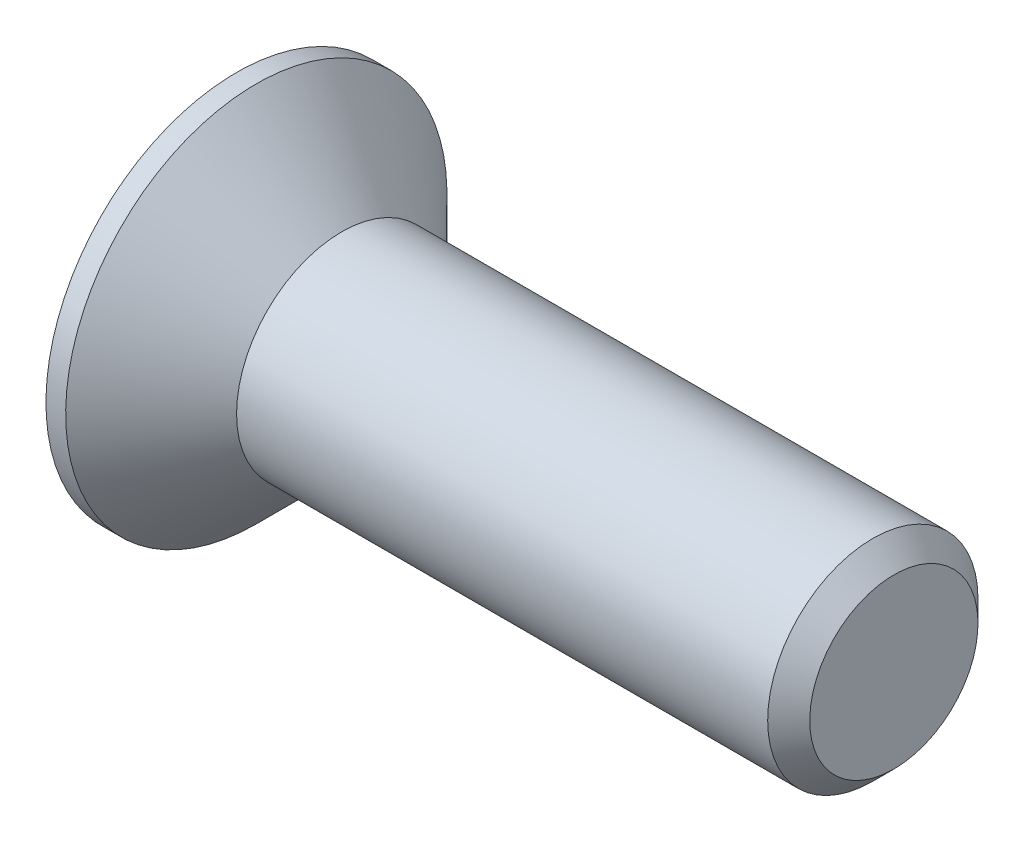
from build123d import *

# Parameters (mm, degrees)
CHAMFER1_SIZE      = 0.8
CUT_EXTRUDE1_DEPTH = 3.45


with BuildPart() as part:
    # Sketch1 → Revolve1 (revolve)
    with BuildSketch(Plane.XY, mode=Mode.PRIVATE) as revolve1_sk:
        Polygon((-4, 7.25), (-4, 0), (21, 0), (21, 4), (0, 4), (-3.25, 7.25), align=None)
    revolve(revolve1_sk.sketch.rotate(Axis((-4, 0, 0), (1, 0, 0)), 180), axis=Axis((-4, 0, 0), (1, 0, 0)))

    # Chamfer1
    chamfer1_edges = [part.edges().sort_by_distance(p)[0] for p in [
        (21, 4, 0),
    ]]
    chamfer(chamfer1_edges, length=CHAMFER1_SIZE)

    # Sketch2 → Cut-Extrude1 (cut)
    with BuildSketch(Plane.ZY.offset(4)):
        Polygon((-1.09, 4.35), (1.09, 4.35), (1.09, 1.09), (4.35, 1.09), (4.35, -1.09), (1.09, -1.09), (1.09, -4.35), (-1.09, -4.35), (-1.09, -1.09), (-4.35, -1.09), (-4.35, 1.09), (-1.09, 1.09), align=None)
    extrude(amount=-CUT_EXTRUDE1_DEPTH, mode=Mode.SUBTRACT)


solid = part.part
